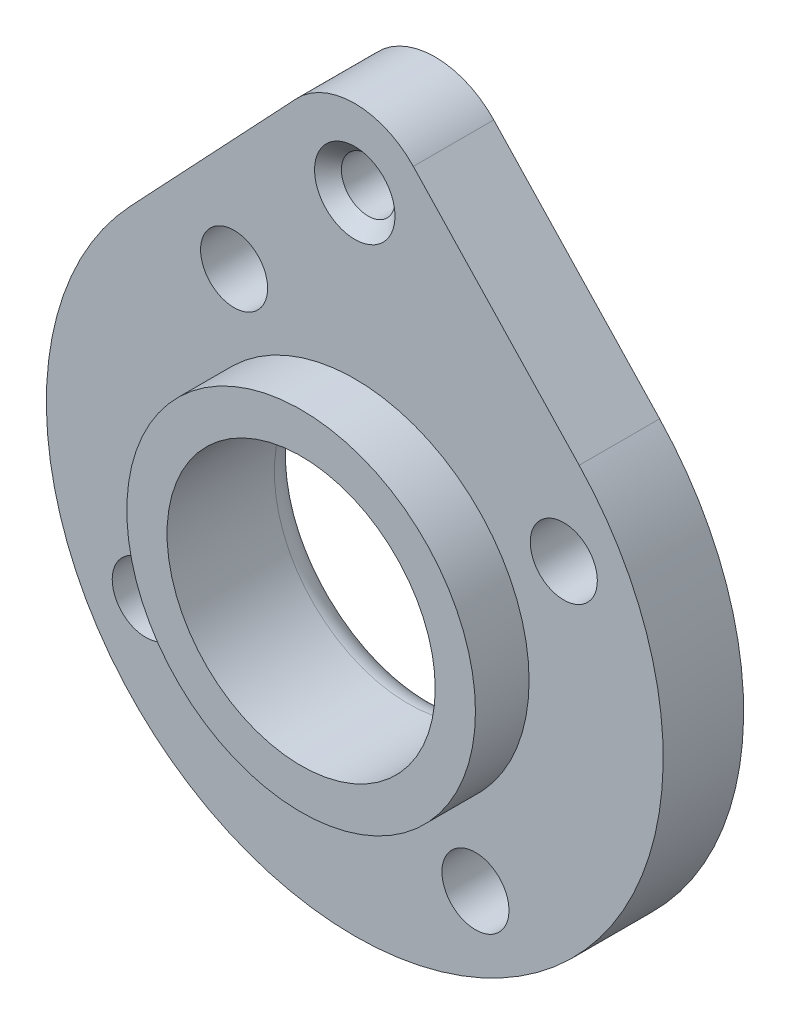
ISO-10303-21;
HEADER;
FILE_DESCRIPTION(('STEP AP214'),'2;1');
FILE_NAME('part.step','',(''),(''),'','','');
FILE_SCHEMA(('AUTOMOTIVE_DESIGN { 1 0 10303 214 1 1 1 1 }'));
ENDSEC;
DATA;
#1=APPLICATION_CONTEXT('core data for automotive mechanical design processes');
#2=APPLICATION_PROTOCOL_DEFINITION('international standard','automotive_design',2000,#1);
#3=PRODUCT_CONTEXT('',#1,'mechanical');
#4=PRODUCT('Part','Part','',(#3));
#5=PRODUCT_RELATED_PRODUCT_CATEGORY('part','',(#4));
#6=PRODUCT_DEFINITION_FORMATION('','',#4);
#7=PRODUCT_DEFINITION_CONTEXT('part definition',#1,'design');
#8=PRODUCT_DEFINITION('design','',#6,#7);
#9=PRODUCT_DEFINITION_SHAPE('','',#8);
#10=(LENGTH_UNIT() NAMED_UNIT(*) SI_UNIT(.MILLI.,.METRE.));
#11=(NAMED_UNIT(*) PLANE_ANGLE_UNIT() SI_UNIT($,.RADIAN.));
#12=(NAMED_UNIT(*) SI_UNIT($,.STERADIAN.) SOLID_ANGLE_UNIT());
#13=UNCERTAINTY_MEASURE_WITH_UNIT(LENGTH_MEASURE(1.E-05),#10,'distance_accuracy_value','');
#14=(GEOMETRIC_REPRESENTATION_CONTEXT(3) GLOBAL_UNCERTAINTY_ASSIGNED_CONTEXT((#13)) GLOBAL_UNIT_ASSIGNED_CONTEXT((#10,
#11,#12)) REPRESENTATION_CONTEXT('',''));
#15=CARTESIAN_POINT('',(0.,0.,0.));
#16=DIRECTION('',(0.,0.,1.));
#17=DIRECTION('',(1.,0.,0.));
#18=AXIS2_PLACEMENT_3D('',#15,#16,#17);
#19=CARTESIAN_POINT('',(0.,24.780131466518,6.));
#20=DIRECTION('',(0.,0.,1.));
#21=DIRECTION('',(1.,0.,0.));
#22=AXIS2_PLACEMENT_3D('',#19,#20,#21);
#23=PLANE('',#22);
#24=CARTESIAN_POINT('',(0.,25.,6.));
#25=DIRECTION('',(0.,0.,-1.));
#26=DIRECTION('',(-1.,0.,0.));
#27=AXIS2_PLACEMENT_3D('',#24,#25,#26);
#28=CIRCLE('',#27,3.);
#29=CARTESIAN_POINT('',(-3.,25.,6.));
#30=VERTEX_POINT('',#29);
#31=EDGE_CURVE('E217',#30,#30,#28,.T.);
#32=ORIENTED_EDGE('',*,*,#31,.T.);
#33=EDGE_LOOP('',(#32));
#34=FACE_BOUND('',#33,.T.);
#35=CARTESIAN_POINT('',(15.5884572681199,9.,6.));
#36=DIRECTION('',(0.,0.,1.));
#37=DIRECTION('',(1.,0.,0.));
#38=AXIS2_PLACEMENT_3D('',#35,#36,#37);
#39=CIRCLE('',#38,2.5);
#40=CARTESIAN_POINT('',(18.0884572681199,9.,6.));
#41=VERTEX_POINT('',#40);
#42=EDGE_CURVE('E159',#41,#41,#39,.T.);
#43=ORIENTED_EDGE('',*,*,#42,.F.);
#44=EDGE_LOOP('',(#43));
#45=FACE_BOUND('',#44,.T.);
#46=CARTESIAN_POINT('',(-9.00000000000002,15.5884572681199,6.));
#47=DIRECTION('',(0.,0.,1.));
#48=DIRECTION('',(1.,0.,0.));
#49=AXIS2_PLACEMENT_3D('',#46,#47,#48);
#50=CIRCLE('',#49,2.5);
#51=CARTESIAN_POINT('',(-6.50000000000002,15.5884572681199,6.));
#52=VERTEX_POINT('',#51);
#53=EDGE_CURVE('E102',#52,#52,#50,.T.);
#54=ORIENTED_EDGE('',*,*,#53,.F.);
#55=EDGE_LOOP('',(#54));
#56=FACE_BOUND('',#55,.T.);
#57=CARTESIAN_POINT('',(0.,24.780131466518,6.));
#58=DIRECTION('',(0.,0.,1.));
#59=DIRECTION('',(1.,0.,0.));
#60=AXIS2_PLACEMENT_3D('',#57,#58,#59);
#61=CIRCLE('',#60,6.);
#62=CARTESIAN_POINT('',(4.36541979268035,28.8963323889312,6.));
#63=VERTEX_POINT('',#62);
#64=CARTESIAN_POINT('',(-4.36541979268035,28.8963323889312,6.));
#65=VERTEX_POINT('',#64);
#66=EDGE_CURVE('E84',#63,#65,#61,.T.);
#67=ORIENTED_EDGE('',*,*,#66,.T.);
#68=DIRECTION('',(-0.686033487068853,-0.727569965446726,0.));
#69=VECTOR('',#68,1.);
#70=CARTESIAN_POINT('',(-4.36541979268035,28.8963323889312,6.));
#71=LINE('',#70,#69);
#72=CARTESIAN_POINT('',(-16.7341092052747,15.7787702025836,6.));
#73=VERTEX_POINT('',#72);
#74=EDGE_CURVE('E79',#65,#73,#71,.T.);
#75=ORIENTED_EDGE('',*,*,#74,.T.);
#76=CARTESIAN_POINT('',(0.,0.,6.));
#77=DIRECTION('',(0.,0.,1.));
#78=DIRECTION('',(1.,0.,0.));
#79=AXIS2_PLACEMENT_3D('',#76,#77,#78);
#80=CIRCLE('',#79,23.);
#81=CARTESIAN_POINT('',(16.7341092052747,15.7787702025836,6.));
#82=VERTEX_POINT('',#81);
#83=EDGE_CURVE('E82',#73,#82,#80,.T.);
#84=ORIENTED_EDGE('',*,*,#83,.T.);
#85=DIRECTION('',(-0.686033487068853,0.727569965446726,0.));
#86=VECTOR('',#85,1.);
#87=CARTESIAN_POINT('',(4.36541979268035,28.8963323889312,6.));
#88=LINE('',#87,#86);
#89=EDGE_CURVE('E48',#82,#63,#88,.T.);
#90=ORIENTED_EDGE('',*,*,#89,.T.);
#91=EDGE_LOOP('',(#67,#75,#84,#90));
#92=FACE_BOUND('',#91,.T.);
#93=CARTESIAN_POINT('',(8.99999999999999,-15.5884572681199,6.));
#94=DIRECTION('',(0.,0.,1.));
#95=DIRECTION('',(-1.,0.,0.));
#96=AXIS2_PLACEMENT_3D('',#93,#94,#95);
#97=CIRCLE('',#96,2.5);
#98=CARTESIAN_POINT('',(6.49999999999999,-15.5884572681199,6.));
#99=VERTEX_POINT('',#98);
#100=EDGE_CURVE('E170',#99,#99,#97,.T.);
#101=ORIENTED_EDGE('',*,*,#100,.F.);
#102=EDGE_LOOP('',(#101));
#103=FACE_BOUND('',#102,.T.);
#104=CARTESIAN_POINT('',(-15.5884572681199,-9.00000000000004,6.));
#105=DIRECTION('',(0.,0.,1.));
#106=DIRECTION('',(-1.,0.,0.));
#107=AXIS2_PLACEMENT_3D('',#104,#105,#106);
#108=CIRCLE('',#107,2.49999999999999);
#109=CARTESIAN_POINT('',(-18.0884572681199,-9.00000000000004,6.));
#110=VERTEX_POINT('',#109);
#111=EDGE_CURVE('E160',#110,#110,#108,.T.);
#112=ORIENTED_EDGE('',*,*,#111,.F.);
#113=EDGE_LOOP('',(#112));
#114=FACE_BOUND('',#113,.T.);
#115=CARTESIAN_POINT('',(0.,0.,6.));
#116=DIRECTION('',(0.,0.,1.));
#117=DIRECTION('',(1.,0.,0.));
#118=AXIS2_PLACEMENT_3D('',#115,#116,#117);
#119=CIRCLE('',#118,13.);
#120=CARTESIAN_POINT('',(13.,0.,6.));
#121=VERTEX_POINT('',#120);
#122=EDGE_CURVE('E230',#121,#121,#119,.T.);
#123=ORIENTED_EDGE('',*,*,#122,.F.);
#124=EDGE_LOOP('',(#123));
#125=FACE_BOUND('',#124,.T.);
#126=ADVANCED_FACE('F31',(#34,#45,#56,#92,#103,#114,#125),#23,.T.);
#127=CARTESIAN_POINT('',(0.,24.780131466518,0.));
#128=DIRECTION('',(0.,0.,1.));
#129=DIRECTION('',(1.,0.,0.));
#130=AXIS2_PLACEMENT_3D('',#127,#128,#129);
#131=PLANE('',#130);
#132=CARTESIAN_POINT('',(0.,0.,0.));
#133=DIRECTION('',(0.,0.,1.));
#134=DIRECTION('',(1.,0.,0.));
#135=AXIS2_PLACEMENT_3D('',#132,#133,#134);
#136=CIRCLE('',#135,12.);
#137=CARTESIAN_POINT('',(12.,0.,0.));
#138=VERTEX_POINT('',#137);
#139=EDGE_CURVE('E40',#138,#138,#136,.T.);
#140=ORIENTED_EDGE('',*,*,#139,.T.);
#141=EDGE_LOOP('',(#140));
#142=FACE_BOUND('',#141,.T.);
#143=CARTESIAN_POINT('',(0.,25.,0.));
#144=DIRECTION('',(0.,0.,-1.));
#145=DIRECTION('',(-1.,0.,0.));
#146=AXIS2_PLACEMENT_3D('',#143,#144,#145);
#147=CIRCLE('',#146,2.);
#148=CARTESIAN_POINT('',(-2.,25.,0.));
#149=VERTEX_POINT('',#148);
#150=EDGE_CURVE('E221',#149,#149,#147,.T.);
#151=ORIENTED_EDGE('',*,*,#150,.F.);
#152=EDGE_LOOP('',(#151));
#153=FACE_BOUND('',#152,.T.);
#154=CARTESIAN_POINT('',(-15.5884572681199,-9.00000000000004,0.));
#155=DIRECTION('',(0.,0.,1.));
#156=DIRECTION('',(-1.,0.,0.));
#157=AXIS2_PLACEMENT_3D('',#154,#155,#156);
#158=CIRCLE('',#157,2.49999999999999);
#159=CARTESIAN_POINT('',(-18.0884572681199,-9.00000000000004,0.));
#160=VERTEX_POINT('',#159);
#161=EDGE_CURVE('E166',#160,#160,#158,.T.);
#162=ORIENTED_EDGE('',*,*,#161,.T.);
#163=EDGE_LOOP('',(#162));
#164=FACE_BOUND('',#163,.T.);
#165=CARTESIAN_POINT('',(8.99999999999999,-15.5884572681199,0.));
#166=DIRECTION('',(0.,0.,1.));
#167=DIRECTION('',(-1.,0.,0.));
#168=AXIS2_PLACEMENT_3D('',#165,#166,#167);
#169=CIRCLE('',#168,2.5);
#170=CARTESIAN_POINT('',(6.49999999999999,-15.5884572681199,0.));
#171=VERTEX_POINT('',#170);
#172=EDGE_CURVE('E163',#171,#171,#169,.T.);
#173=ORIENTED_EDGE('',*,*,#172,.T.);
#174=EDGE_LOOP('',(#173));
#175=FACE_BOUND('',#174,.T.);
#176=CARTESIAN_POINT('',(0.,24.780131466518,0.));
#177=DIRECTION('',(0.,0.,1.));
#178=DIRECTION('',(1.,0.,0.));
#179=AXIS2_PLACEMENT_3D('',#176,#177,#178);
#180=CIRCLE('',#179,6.);
#181=CARTESIAN_POINT('',(4.36541979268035,28.8963323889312,0.));
#182=VERTEX_POINT('',#181);
#183=CARTESIAN_POINT('',(-4.36541979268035,28.8963323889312,0.));
#184=VERTEX_POINT('',#183);
#185=EDGE_CURVE('E99',#182,#184,#180,.T.);
#186=ORIENTED_EDGE('',*,*,#185,.F.);
#187=DIRECTION('',(-0.686033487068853,0.727569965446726,0.));
#188=VECTOR('',#187,1.);
#189=CARTESIAN_POINT('',(4.36541979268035,28.8963323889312,0.));
#190=LINE('',#189,#188);
#191=CARTESIAN_POINT('',(16.7341092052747,15.7787702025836,0.));
#192=VERTEX_POINT('',#191);
#193=EDGE_CURVE('E71',#192,#182,#190,.T.);
#194=ORIENTED_EDGE('',*,*,#193,.F.);
#195=CARTESIAN_POINT('',(0.,0.,0.));
#196=DIRECTION('',(0.,0.,1.));
#197=DIRECTION('',(1.,0.,0.));
#198=AXIS2_PLACEMENT_3D('',#195,#196,#197);
#199=CIRCLE('',#198,23.);
#200=CARTESIAN_POINT('',(-16.7341092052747,15.7787702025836,0.));
#201=VERTEX_POINT('',#200);
#202=EDGE_CURVE('E65',#201,#192,#199,.T.);
#203=ORIENTED_EDGE('',*,*,#202,.F.);
#204=DIRECTION('',(-0.686033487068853,-0.727569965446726,0.));
#205=VECTOR('',#204,1.);
#206=CARTESIAN_POINT('',(-4.36541979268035,28.8963323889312,0.));
#207=LINE('',#206,#205);
#208=EDGE_CURVE('E89',#184,#201,#207,.T.);
#209=ORIENTED_EDGE('',*,*,#208,.F.);
#210=EDGE_LOOP('',(#186,#194,#203,#209));
#211=FACE_BOUND('',#210,.T.);
#212=CARTESIAN_POINT('',(-9.00000000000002,15.5884572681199,0.));
#213=DIRECTION('',(0.,0.,1.));
#214=DIRECTION('',(1.,0.,0.));
#215=AXIS2_PLACEMENT_3D('',#212,#213,#214);
#216=CIRCLE('',#215,2.5);
#217=CARTESIAN_POINT('',(-6.50000000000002,15.5884572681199,0.));
#218=VERTEX_POINT('',#217);
#219=EDGE_CURVE('E154',#218,#218,#216,.T.);
#220=ORIENTED_EDGE('',*,*,#219,.T.);
#221=EDGE_LOOP('',(#220));
#222=FACE_BOUND('',#221,.T.);
#223=CARTESIAN_POINT('',(15.5884572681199,9.,0.));
#224=DIRECTION('',(0.,0.,1.));
#225=DIRECTION('',(1.,0.,0.));
#226=AXIS2_PLACEMENT_3D('',#223,#224,#225);
#227=CIRCLE('',#226,2.5);
#228=CARTESIAN_POINT('',(18.0884572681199,9.,0.));
#229=VERTEX_POINT('',#228);
#230=EDGE_CURVE('E157',#229,#229,#227,.T.);
#231=ORIENTED_EDGE('',*,*,#230,.T.);
#232=EDGE_LOOP('',(#231));
#233=FACE_BOUND('',#232,.T.);
#234=ADVANCED_FACE('F111',(#142,#153,#164,#175,#211,#222,#233),#131,.F.);
#235=CARTESIAN_POINT('',(0.,24.780131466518,6.));
#236=DIRECTION('',(0.,0.,-1.));
#237=DIRECTION('',(-1.,0.,0.));
#238=AXIS2_PLACEMENT_3D('',#235,#236,#237);
#239=CYLINDRICAL_SURFACE('',#238,6.);
#240=ORIENTED_EDGE('',*,*,#185,.T.);
#241=DIRECTION('',(0.,0.,-1.));
#242=VECTOR('',#241,1.);
#243=CARTESIAN_POINT('',(-4.36541979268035,28.8963323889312,6.));
#244=LINE('',#243,#242);
#245=EDGE_CURVE('E90',#65,#184,#244,.T.);
#246=ORIENTED_EDGE('',*,*,#245,.F.);
#247=ORIENTED_EDGE('',*,*,#66,.F.);
#248=DIRECTION('',(0.,0.,-1.));
#249=VECTOR('',#248,1.);
#250=CARTESIAN_POINT('',(4.36541979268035,28.8963323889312,6.));
#251=LINE('',#250,#249);
#252=EDGE_CURVE('E95',#63,#182,#251,.T.);
#253=ORIENTED_EDGE('',*,*,#252,.T.);
#254=EDGE_LOOP('',(#240,#246,#247,#253));
#255=FACE_BOUND('',#254,.T.);
#256=ADVANCED_FACE('F130',(#255),#239,.T.);
#257=CARTESIAN_POINT('',(-4.36541979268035,28.8963323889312,6.));
#258=DIRECTION('',(0.727569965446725,-0.686033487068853,0.));
#259=DIRECTION('',(0.686033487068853,0.727569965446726,0.));
#260=AXIS2_PLACEMENT_3D('',#257,#258,#259);
#261=PLANE('',#260);
#262=ORIENTED_EDGE('',*,*,#208,.T.);
#263=DIRECTION('',(0.,0.,-1.));
#264=VECTOR('',#263,1.);
#265=CARTESIAN_POINT('',(-16.7341092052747,15.7787702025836,6.));
#266=LINE('',#265,#264);
#267=EDGE_CURVE('E87',#73,#201,#266,.T.);
#268=ORIENTED_EDGE('',*,*,#267,.F.);
#269=ORIENTED_EDGE('',*,*,#74,.F.);
#270=ORIENTED_EDGE('',*,*,#245,.T.);
#271=EDGE_LOOP('',(#262,#268,#269,#270));
#272=FACE_BOUND('',#271,.T.);
#273=ADVANCED_FACE('F88',(#272),#261,.F.);
#274=CARTESIAN_POINT('',(0.,0.,6.));
#275=DIRECTION('',(0.,0.,-1.));
#276=DIRECTION('',(-1.,0.,0.));
#277=AXIS2_PLACEMENT_3D('',#274,#275,#276);
#278=CYLINDRICAL_SURFACE('',#277,23.);
#279=ORIENTED_EDGE('',*,*,#202,.T.);
#280=DIRECTION('',(0.,0.,-1.));
#281=VECTOR('',#280,1.);
#282=CARTESIAN_POINT('',(16.7341092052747,15.7787702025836,6.));
#283=LINE('',#282,#281);
#284=EDGE_CURVE('E91',#82,#192,#283,.T.);
#285=ORIENTED_EDGE('',*,*,#284,.F.);
#286=ORIENTED_EDGE('',*,*,#83,.F.);
#287=ORIENTED_EDGE('',*,*,#267,.T.);
#288=EDGE_LOOP('',(#279,#285,#286,#287));
#289=FACE_BOUND('',#288,.T.);
#290=ADVANCED_FACE('F93',(#289),#278,.T.);
#291=CARTESIAN_POINT('',(4.36541979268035,28.8963323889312,6.));
#292=DIRECTION('',(-0.727569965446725,-0.686033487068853,0.));
#293=DIRECTION('',(0.686033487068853,-0.727569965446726,0.));
#294=AXIS2_PLACEMENT_3D('',#291,#292,#293);
#295=PLANE('',#294);
#296=ORIENTED_EDGE('',*,*,#193,.T.);
#297=ORIENTED_EDGE('',*,*,#252,.F.);
#298=ORIENTED_EDGE('',*,*,#89,.F.);
#299=ORIENTED_EDGE('',*,*,#284,.T.);
#300=EDGE_LOOP('',(#296,#297,#298,#299));
#301=FACE_BOUND('',#300,.T.);
#302=ADVANCED_FACE('F138',(#301),#295,.F.);
#303=CARTESIAN_POINT('',(-9.00000000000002,15.5884572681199,6.));
#304=DIRECTION('',(0.,0.,-1.));
#305=DIRECTION('',(-1.,0.,0.));
#306=AXIS2_PLACEMENT_3D('',#303,#304,#305);
#307=CYLINDRICAL_SURFACE('',#306,2.5);
#308=ORIENTED_EDGE('',*,*,#53,.T.);
#309=EDGE_LOOP('',(#308));
#310=FACE_BOUND('',#309,.T.);
#311=ORIENTED_EDGE('',*,*,#219,.F.);
#312=EDGE_LOOP('',(#311));
#313=FACE_BOUND('',#312,.T.);
#314=ADVANCED_FACE('F135',(#310,#313),#307,.F.);
#315=CARTESIAN_POINT('',(8.99999999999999,-15.5884572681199,6.));
#316=DIRECTION('',(0.,0.,-1.));
#317=DIRECTION('',(-1.,0.,0.));
#318=AXIS2_PLACEMENT_3D('',#315,#316,#317);
#319=CYLINDRICAL_SURFACE('',#318,2.5);
#320=ORIENTED_EDGE('',*,*,#100,.T.);
#321=EDGE_LOOP('',(#320));
#322=FACE_BOUND('',#321,.T.);
#323=ORIENTED_EDGE('',*,*,#172,.F.);
#324=EDGE_LOOP('',(#323));
#325=FACE_BOUND('',#324,.T.);
#326=ADVANCED_FACE('F182',(#322,#325),#319,.F.);
#327=CARTESIAN_POINT('',(15.5884572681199,9.,6.));
#328=DIRECTION('',(0.,0.,-1.));
#329=DIRECTION('',(-1.,0.,0.));
#330=AXIS2_PLACEMENT_3D('',#327,#328,#329);
#331=CYLINDRICAL_SURFACE('',#330,2.5);
#332=ORIENTED_EDGE('',*,*,#42,.T.);
#333=EDGE_LOOP('',(#332));
#334=FACE_BOUND('',#333,.T.);
#335=ORIENTED_EDGE('',*,*,#230,.F.);
#336=EDGE_LOOP('',(#335));
#337=FACE_BOUND('',#336,.T.);
#338=ADVANCED_FACE('F186',(#334,#337),#331,.F.);
#339=CARTESIAN_POINT('',(-15.5884572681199,-9.00000000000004,6.));
#340=DIRECTION('',(0.,0.,-1.));
#341=DIRECTION('',(-1.,0.,0.));
#342=AXIS2_PLACEMENT_3D('',#339,#340,#341);
#343=CYLINDRICAL_SURFACE('',#342,2.49999999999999);
#344=ORIENTED_EDGE('',*,*,#111,.T.);
#345=EDGE_LOOP('',(#344));
#346=FACE_BOUND('',#345,.T.);
#347=ORIENTED_EDGE('',*,*,#161,.F.);
#348=EDGE_LOOP('',(#347));
#349=FACE_BOUND('',#348,.T.);
#350=ADVANCED_FACE('F191',(#346,#349),#343,.F.);
#351=CARTESIAN_POINT('',(0.,0.,6.));
#352=DIRECTION('',(0.,0.,-1.));
#353=DIRECTION('',(-1.,0.,0.));
#354=AXIS2_PLACEMENT_3D('',#351,#352,#353);
#355=CYLINDRICAL_SURFACE('',#354,10.);
#356=CARTESIAN_POINT('',(0.,0.,2.));
#357=DIRECTION('',(0.,0.,1.));
#358=DIRECTION('',(1.,0.,0.));
#359=AXIS2_PLACEMENT_3D('',#356,#357,#358);
#360=CIRCLE('',#359,10.);
#361=CARTESIAN_POINT('',(10.,0.,2.));
#362=VERTEX_POINT('',#361);
#363=EDGE_CURVE('E11',#362,#362,#360,.F.);
#364=ORIENTED_EDGE('',*,*,#363,.T.);
#365=EDGE_LOOP('',(#364));
#366=FACE_BOUND('',#365,.T.);
#367=CARTESIAN_POINT('',(0.,0.,10.));
#368=DIRECTION('',(0.,0.,1.));
#369=DIRECTION('',(1.,0.,0.));
#370=AXIS2_PLACEMENT_3D('',#367,#368,#369);
#371=CIRCLE('',#370,10.);
#372=CARTESIAN_POINT('',(10.,0.,10.));
#373=VERTEX_POINT('',#372);
#374=EDGE_CURVE('E223',#373,#373,#371,.T.);
#375=ORIENTED_EDGE('',*,*,#374,.T.);
#376=EDGE_LOOP('',(#375));
#377=FACE_BOUND('',#376,.T.);
#378=ADVANCED_FACE('F198',(#366,#377),#355,.F.);
#379=CARTESIAN_POINT('',(0.,0.,10.));
#380=DIRECTION('',(0.,0.,1.));
#381=DIRECTION('',(1.,0.,0.));
#382=AXIS2_PLACEMENT_3D('',#379,#380,#381);
#383=PLANE('',#382);
#384=CARTESIAN_POINT('',(0.,0.,10.));
#385=DIRECTION('',(0.,0.,1.));
#386=DIRECTION('',(1.,0.,0.));
#387=AXIS2_PLACEMENT_3D('',#384,#385,#386);
#388=CIRCLE('',#387,13.);
#389=CARTESIAN_POINT('',(13.,0.,10.));
#390=VERTEX_POINT('',#389);
#391=EDGE_CURVE('E231',#390,#390,#388,.T.);
#392=ORIENTED_EDGE('',*,*,#391,.T.);
#393=EDGE_LOOP('',(#392));
#394=FACE_BOUND('',#393,.T.);
#395=ORIENTED_EDGE('',*,*,#374,.F.);
#396=EDGE_LOOP('',(#395));
#397=FACE_BOUND('',#396,.T.);
#398=ADVANCED_FACE('F202',(#394,#397),#383,.T.);
#399=CARTESIAN_POINT('',(0.,0.,10.));
#400=DIRECTION('',(0.,0.,-1.));
#401=DIRECTION('',(-1.,0.,0.));
#402=AXIS2_PLACEMENT_3D('',#399,#400,#401);
#403=CYLINDRICAL_SURFACE('',#402,13.);
#404=ORIENTED_EDGE('',*,*,#391,.F.);
#405=EDGE_LOOP('',(#404));
#406=FACE_BOUND('',#405,.T.);
#407=ORIENTED_EDGE('',*,*,#122,.T.);
#408=EDGE_LOOP('',(#407));
#409=FACE_BOUND('',#408,.T.);
#410=ADVANCED_FACE('F204',(#406,#409),#403,.T.);
#411=CARTESIAN_POINT('',(0.,25.,5.));
#412=DIRECTION('',(0.,0.,1.));
#413=DIRECTION('',(1.,0.,0.));
#414=AXIS2_PLACEMENT_3D('',#411,#412,#413);
#415=CONICAL_SURFACE('',#414,2.,0.785398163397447);
#416=ORIENTED_EDGE('',*,*,#31,.F.);
#417=EDGE_LOOP('',(#416));
#418=FACE_BOUND('',#417,.T.);
#419=CARTESIAN_POINT('',(0.,25.,5.));
#420=DIRECTION('',(0.,0.,-1.));
#421=DIRECTION('',(-1.,0.,0.));
#422=AXIS2_PLACEMENT_3D('',#419,#420,#421);
#423=CIRCLE('',#422,2.);
#424=CARTESIAN_POINT('',(-2.,25.,5.));
#425=VERTEX_POINT('',#424);
#426=EDGE_CURVE('E220',#425,#425,#423,.T.);
#427=ORIENTED_EDGE('',*,*,#426,.T.);
#428=EDGE_LOOP('',(#427));
#429=FACE_BOUND('',#428,.T.);
#430=ADVANCED_FACE('F120',(#418,#429),#415,.F.);
#431=CARTESIAN_POINT('',(0.,25.,0.));
#432=DIRECTION('',(0.,0.,-1.));
#433=DIRECTION('',(-1.,0.,0.));
#434=AXIS2_PLACEMENT_3D('',#431,#432,#433);
#435=CYLINDRICAL_SURFACE('',#434,2.);
#436=ORIENTED_EDGE('',*,*,#426,.F.);
#437=EDGE_LOOP('',(#436));
#438=FACE_BOUND('',#437,.T.);
#439=ORIENTED_EDGE('',*,*,#150,.T.);
#440=EDGE_LOOP('',(#439));
#441=FACE_BOUND('',#440,.T.);
#442=ADVANCED_FACE('F115',(#438,#441),#435,.F.);
#443=CARTESIAN_POINT('',(0.,0.,2.));
#444=DIRECTION('',(0.,0.,1.));
#445=DIRECTION('',(1.,0.,0.));
#446=AXIS2_PLACEMENT_3D('',#443,#444,#445);
#447=TOROIDAL_SURFACE('',#446,12.,2.);
#448=ORIENTED_EDGE('',*,*,#363,.F.);
#449=EDGE_LOOP('',(#448));
#450=FACE_BOUND('',#449,.T.);
#451=ORIENTED_EDGE('',*,*,#139,.F.);
#452=EDGE_LOOP('',(#451));
#453=FACE_BOUND('',#452,.T.);
#454=ADVANCED_FACE('F33',(#450,#453),#447,.T.);
#455=CLOSED_SHELL('',(#126,#234,#256,#273,#290,#302,#314,#326,#338,#350,#378,#398,#410,#430,
#442,#454));
#456=MANIFOLD_SOLID_BREP('B2',#455);
#457=ADVANCED_BREP_SHAPE_REPRESENTATION('',(#18,#456),#14);
#458=SHAPE_DEFINITION_REPRESENTATION(#9,#457);
ENDSEC;
END-ISO-10303-21;
